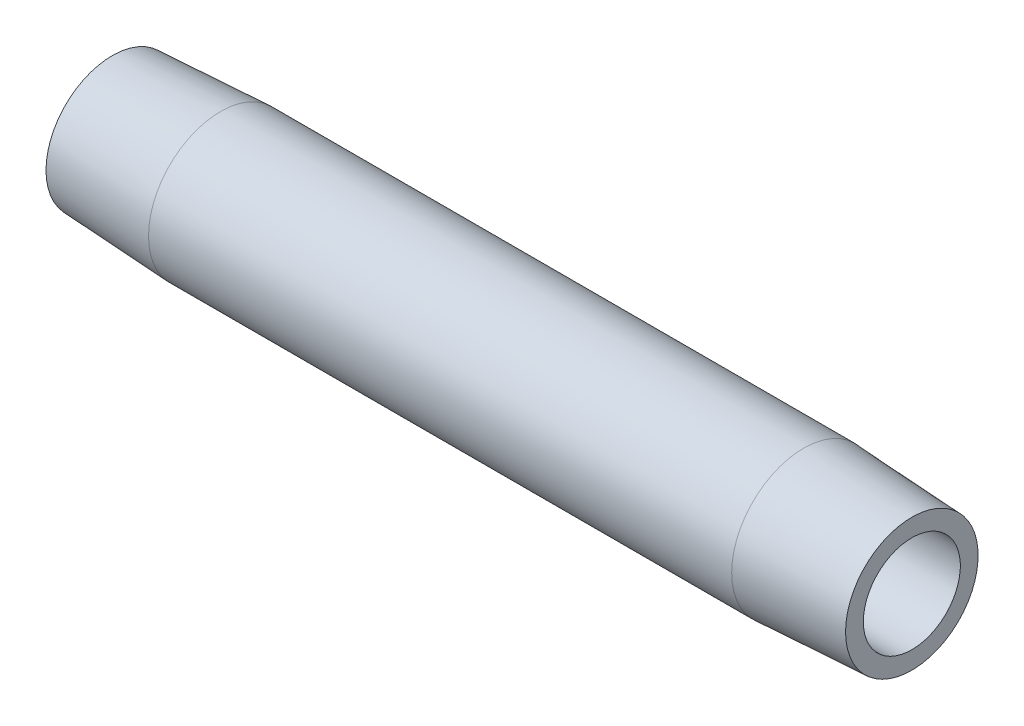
from build123d import *


with BuildPart() as part:
    # Sketch1 → Revolve1 (revolve)
    with BuildSketch(Plane(origin=(0, 0, 0), x_dir=(1, 0, 0), z_dir=(0, 1, 0)), mode=Mode.PRIVATE) as revolve1_sk:
        Polygon((76.2, 4.622776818), (0, 4.622776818), (0, 6.317526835), (10.3124, 6.857976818), (65.8876, 6.857976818), (76.2, 6.317526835), align=None)
    revolve(revolve1_sk.sketch.rotate(Axis((-6.375994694, 0, 0), (1, 0, 0)), 180), axis=Axis((-6.375994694, 0, 0), (1, 0, 0)))


solid = part.part
